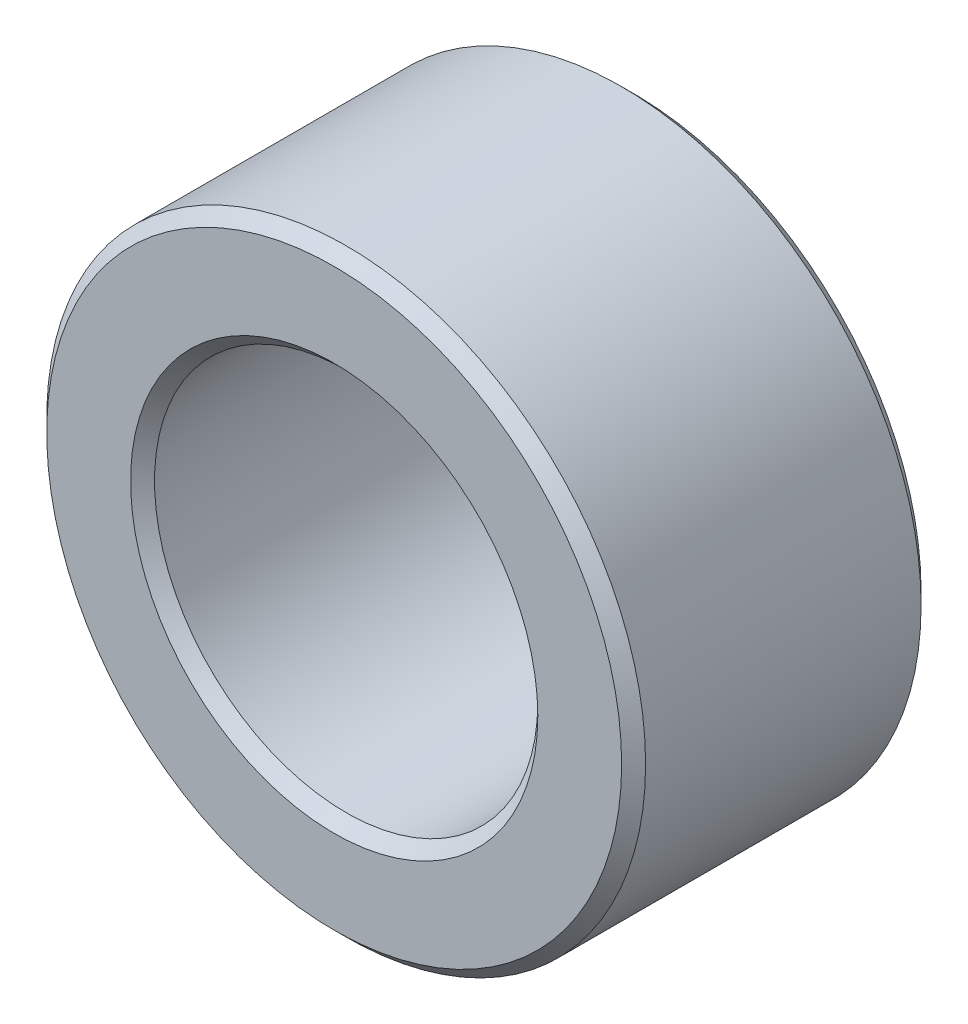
from build123d import *

# Parameters (mm, degrees)
SKETCH1_R           = 5
SKETCH1_R_2         = 3.2
BOSS_EXTRUDE2_DEPTH = 2.5
CHAMFER3_SIZE       = 0.2


with BuildPart() as part:
    # Sketch1 → Boss-Extrude2 (new, symmetric)
    with BuildSketch(Plane.XY):
        Circle(SKETCH1_R)
        Circle(SKETCH1_R_2, mode=Mode.SUBTRACT)
    extrude(amount=BOSS_EXTRUDE2_DEPTH, both=True)

    # Chamfer3
    chamfer3_edges = [part.edges().sort_by_distance(p)[0] for p in [
        (-5, 0, -2.5),
        (-5, 0, 2.5),
        (-3.2, 0, -2.5),
        (-3.2, 0, 2.5),
    ]]
    chamfer(chamfer3_edges, length=CHAMFER3_SIZE)


solid = part.part
